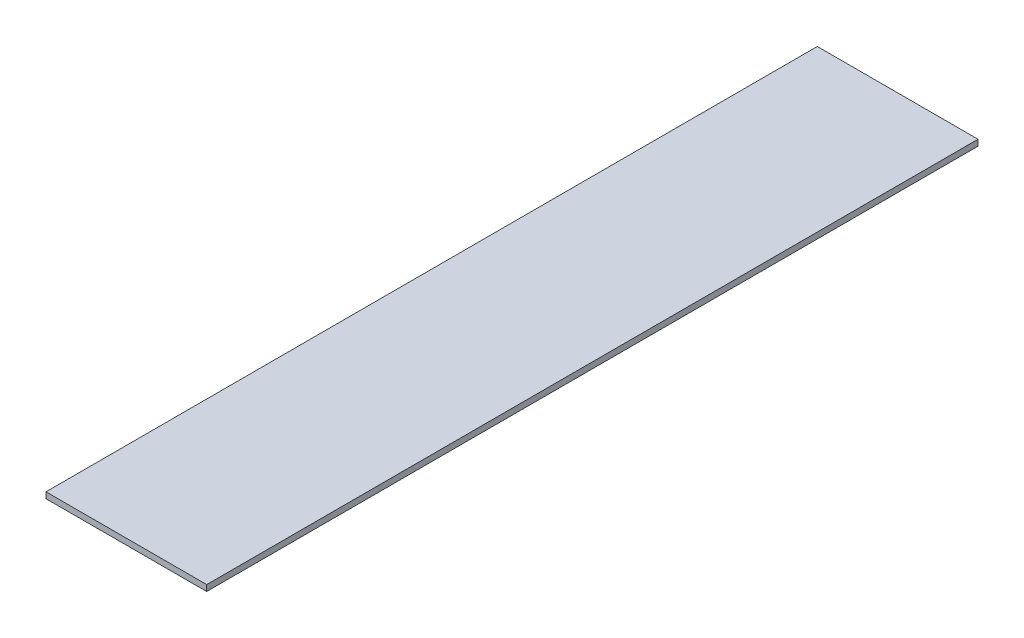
ISO-10303-21;
HEADER;
FILE_DESCRIPTION(('STEP AP214'),'2;1');
FILE_NAME('part.step','',(''),(''),'','','');
FILE_SCHEMA(('AUTOMOTIVE_DESIGN { 1 0 10303 214 1 1 1 1 }'));
ENDSEC;
DATA;
#1=APPLICATION_CONTEXT('core data for automotive mechanical design processes');
#2=APPLICATION_PROTOCOL_DEFINITION('international standard','automotive_design',2000,#1);
#3=PRODUCT_CONTEXT('',#1,'mechanical');
#4=PRODUCT('Part','Part','',(#3));
#5=PRODUCT_RELATED_PRODUCT_CATEGORY('part','',(#4));
#6=PRODUCT_DEFINITION_FORMATION('','',#4);
#7=PRODUCT_DEFINITION_CONTEXT('part definition',#1,'design');
#8=PRODUCT_DEFINITION('design','',#6,#7);
#9=PRODUCT_DEFINITION_SHAPE('','',#8);
#10=(LENGTH_UNIT() NAMED_UNIT(*) SI_UNIT(.MILLI.,.METRE.));
#11=(NAMED_UNIT(*) PLANE_ANGLE_UNIT() SI_UNIT($,.RADIAN.));
#12=(NAMED_UNIT(*) SI_UNIT($,.STERADIAN.) SOLID_ANGLE_UNIT());
#13=UNCERTAINTY_MEASURE_WITH_UNIT(LENGTH_MEASURE(1.E-05),#10,'distance_accuracy_value','');
#14=(GEOMETRIC_REPRESENTATION_CONTEXT(3) GLOBAL_UNCERTAINTY_ASSIGNED_CONTEXT((#13)) GLOBAL_UNIT_ASSIGNED_CONTEXT((#10,
#11,#12)) REPRESENTATION_CONTEXT('',''));
#15=CARTESIAN_POINT('',(0.,0.,0.));
#16=DIRECTION('',(0.,0.,1.));
#17=DIRECTION('',(1.,0.,0.));
#18=AXIS2_PLACEMENT_3D('',#15,#16,#17);
#19=CARTESIAN_POINT('',(0.,4.7625,0.));
#20=DIRECTION('',(1.,0.,0.));
#21=DIRECTION('',(0.,0.,-1.));
#22=AXIS2_PLACEMENT_3D('',#19,#20,#21);
#23=PLANE('',#22);
#24=DIRECTION('',(0.,0.,1.));
#25=VECTOR('',#24,1.);
#26=CARTESIAN_POINT('',(0.,0.,0.));
#27=LINE('',#26,#25);
#28=CARTESIAN_POINT('',(0.,0.,-609.6));
#29=VERTEX_POINT('',#28);
#30=CARTESIAN_POINT('',(0.,0.,0.));
#31=VERTEX_POINT('',#30);
#32=EDGE_CURVE('E96',#29,#31,#27,.T.);
#33=ORIENTED_EDGE('',*,*,#32,.T.);
#34=DIRECTION('',(0.,-1.,0.));
#35=VECTOR('',#34,1.);
#36=CARTESIAN_POINT('',(0.,4.7625,0.));
#37=LINE('',#36,#35);
#38=CARTESIAN_POINT('',(0.,4.7625,0.));
#39=VERTEX_POINT('',#38);
#40=EDGE_CURVE('E11',#39,#31,#37,.T.);
#41=ORIENTED_EDGE('',*,*,#40,.F.);
#42=DIRECTION('',(0.,0.,1.));
#43=VECTOR('',#42,1.);
#44=CARTESIAN_POINT('',(0.,4.7625,0.));
#45=LINE('',#44,#43);
#46=CARTESIAN_POINT('',(0.,4.7625,-609.6));
#47=VERTEX_POINT('',#46);
#48=EDGE_CURVE('E84',#47,#39,#45,.T.);
#49=ORIENTED_EDGE('',*,*,#48,.F.);
#50=DIRECTION('',(0.,-1.,0.));
#51=VECTOR('',#50,1.);
#52=CARTESIAN_POINT('',(0.,4.7625,-609.6));
#53=LINE('',#52,#51);
#54=EDGE_CURVE('E92',#47,#29,#53,.T.);
#55=ORIENTED_EDGE('',*,*,#54,.T.);
#56=EDGE_LOOP('',(#33,#41,#49,#55));
#57=FACE_BOUND('',#56,.T.);
#58=ADVANCED_FACE('F33',(#57),#23,.F.);
#59=CARTESIAN_POINT('',(0.,4.7625,0.));
#60=DIRECTION('',(0.,0.,-1.));
#61=DIRECTION('',(-1.,0.,0.));
#62=AXIS2_PLACEMENT_3D('',#59,#60,#61);
#63=PLANE('',#62);
#64=DIRECTION('',(1.,0.,0.));
#65=VECTOR('',#64,1.);
#66=CARTESIAN_POINT('',(0.,0.,0.));
#67=LINE('',#66,#65);
#68=CARTESIAN_POINT('',(127.,0.,0.));
#69=VERTEX_POINT('',#68);
#70=EDGE_CURVE('E88',#31,#69,#67,.T.);
#71=ORIENTED_EDGE('',*,*,#70,.T.);
#72=DIRECTION('',(0.,-1.,0.));
#73=VECTOR('',#72,1.);
#74=CARTESIAN_POINT('',(127.,4.7625,0.));
#75=LINE('',#74,#73);
#76=CARTESIAN_POINT('',(127.,4.7625,0.));
#77=VERTEX_POINT('',#76);
#78=EDGE_CURVE('E41',#77,#69,#75,.T.);
#79=ORIENTED_EDGE('',*,*,#78,.F.);
#80=DIRECTION('',(1.,0.,0.));
#81=VECTOR('',#80,1.);
#82=CARTESIAN_POINT('',(0.,4.7625,0.));
#83=LINE('',#82,#81);
#84=EDGE_CURVE('E79',#39,#77,#83,.T.);
#85=ORIENTED_EDGE('',*,*,#84,.F.);
#86=ORIENTED_EDGE('',*,*,#40,.T.);
#87=EDGE_LOOP('',(#71,#79,#85,#86));
#88=FACE_BOUND('',#87,.T.);
#89=ADVANCED_FACE('F87',(#88),#63,.F.);
#90=CARTESIAN_POINT('',(127.,4.7625,0.));
#91=DIRECTION('',(-1.,0.,0.));
#92=DIRECTION('',(0.,0.,1.));
#93=AXIS2_PLACEMENT_3D('',#90,#91,#92);
#94=PLANE('',#93);
#95=DIRECTION('',(0.,0.,-1.));
#96=VECTOR('',#95,1.);
#97=CARTESIAN_POINT('',(127.,0.,0.));
#98=LINE('',#97,#96);
#99=CARTESIAN_POINT('',(127.,0.,-609.6));
#100=VERTEX_POINT('',#99);
#101=EDGE_CURVE('E66',#69,#100,#98,.T.);
#102=ORIENTED_EDGE('',*,*,#101,.T.);
#103=DIRECTION('',(0.,-1.,0.));
#104=VECTOR('',#103,1.);
#105=CARTESIAN_POINT('',(127.,4.7625,-609.6));
#106=LINE('',#105,#104);
#107=CARTESIAN_POINT('',(127.,4.7625,-609.6));
#108=VERTEX_POINT('',#107);
#109=EDGE_CURVE('E89',#108,#100,#106,.T.);
#110=ORIENTED_EDGE('',*,*,#109,.F.);
#111=DIRECTION('',(0.,0.,-1.));
#112=VECTOR('',#111,1.);
#113=CARTESIAN_POINT('',(127.,4.7625,0.));
#114=LINE('',#113,#112);
#115=EDGE_CURVE('E82',#77,#108,#114,.T.);
#116=ORIENTED_EDGE('',*,*,#115,.F.);
#117=ORIENTED_EDGE('',*,*,#78,.T.);
#118=EDGE_LOOP('',(#102,#110,#116,#117));
#119=FACE_BOUND('',#118,.T.);
#120=ADVANCED_FACE('F90',(#119),#94,.F.);
#121=CARTESIAN_POINT('',(0.,4.7625,-609.6));
#122=DIRECTION('',(0.,0.,1.));
#123=DIRECTION('',(1.,0.,0.));
#124=AXIS2_PLACEMENT_3D('',#121,#122,#123);
#125=PLANE('',#124);
#126=DIRECTION('',(-1.,0.,0.));
#127=VECTOR('',#126,1.);
#128=CARTESIAN_POINT('',(0.,0.,-609.6));
#129=LINE('',#128,#127);
#130=EDGE_CURVE('E72',#100,#29,#129,.T.);
#131=ORIENTED_EDGE('',*,*,#130,.T.);
#132=ORIENTED_EDGE('',*,*,#54,.F.);
#133=DIRECTION('',(-1.,0.,0.));
#134=VECTOR('',#133,1.);
#135=CARTESIAN_POINT('',(0.,4.7625,-609.6));
#136=LINE('',#135,#134);
#137=EDGE_CURVE('E49',#108,#47,#136,.T.);
#138=ORIENTED_EDGE('',*,*,#137,.F.);
#139=ORIENTED_EDGE('',*,*,#109,.T.);
#140=EDGE_LOOP('',(#131,#132,#138,#139));
#141=FACE_BOUND('',#140,.T.);
#142=ADVANCED_FACE('F103',(#141),#125,.F.);
#143=CARTESIAN_POINT('',(0.,4.7625,0.));
#144=DIRECTION('',(0.,-1.,0.));
#145=DIRECTION('',(0.,0.,-1.));
#146=AXIS2_PLACEMENT_3D('',#143,#144,#145);
#147=PLANE('',#146);
#148=ORIENTED_EDGE('',*,*,#48,.T.);
#149=ORIENTED_EDGE('',*,*,#84,.T.);
#150=ORIENTED_EDGE('',*,*,#115,.T.);
#151=ORIENTED_EDGE('',*,*,#137,.T.);
#152=EDGE_LOOP('',(#148,#149,#150,#151));
#153=FACE_BOUND('',#152,.T.);
#154=ADVANCED_FACE('F80',(#153),#147,.F.);
#155=CARTESIAN_POINT('',(0.,0.,0.));
#156=DIRECTION('',(0.,-1.,0.));
#157=DIRECTION('',(0.,0.,-1.));
#158=AXIS2_PLACEMENT_3D('',#155,#156,#157);
#159=PLANE('',#158);
#160=ORIENTED_EDGE('',*,*,#32,.F.);
#161=ORIENTED_EDGE('',*,*,#130,.F.);
#162=ORIENTED_EDGE('',*,*,#101,.F.);
#163=ORIENTED_EDGE('',*,*,#70,.F.);
#164=EDGE_LOOP('',(#160,#161,#162,#163));
#165=FACE_BOUND('',#164,.T.);
#166=ADVANCED_FACE('F106',(#165),#159,.T.);
#167=CLOSED_SHELL('',(#58,#89,#120,#142,#154,#166));
#168=MANIFOLD_SOLID_BREP('B2',#167);
#169=ADVANCED_BREP_SHAPE_REPRESENTATION('',(#18,#168),#14);
#170=SHAPE_DEFINITION_REPRESENTATION(#9,#169);
ENDSEC;
END-ISO-10303-21;
